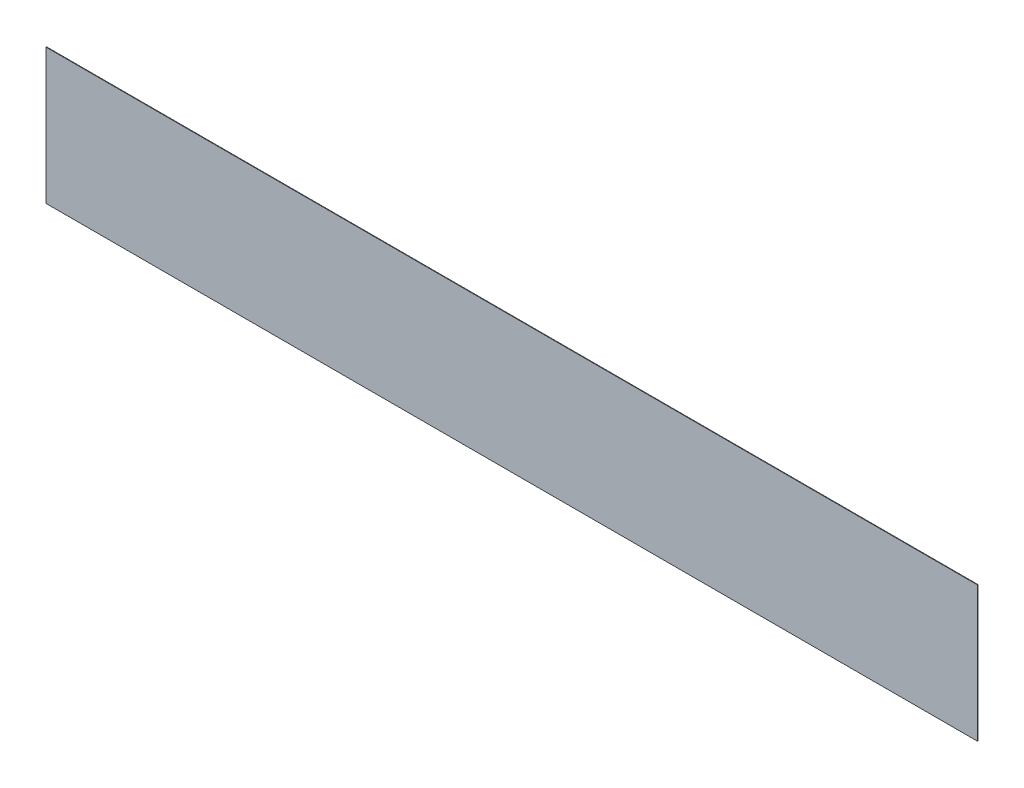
from build123d import *

# Parameters (mm, degrees)
SKETCH1_W           = 172
SKETCH1_H           = 25
BOSS_EXTRUDE1_DEPTH = 0.1


with BuildPart() as part:
    # Sketch1 → Boss-Extrude1 (new body)
    with BuildSketch(Plane.XY):
        with Locations((93, 12.5)):
            Rectangle(SKETCH1_W, SKETCH1_H)
    extrude(amount=BOSS_EXTRUDE1_DEPTH)


solid = part.part
